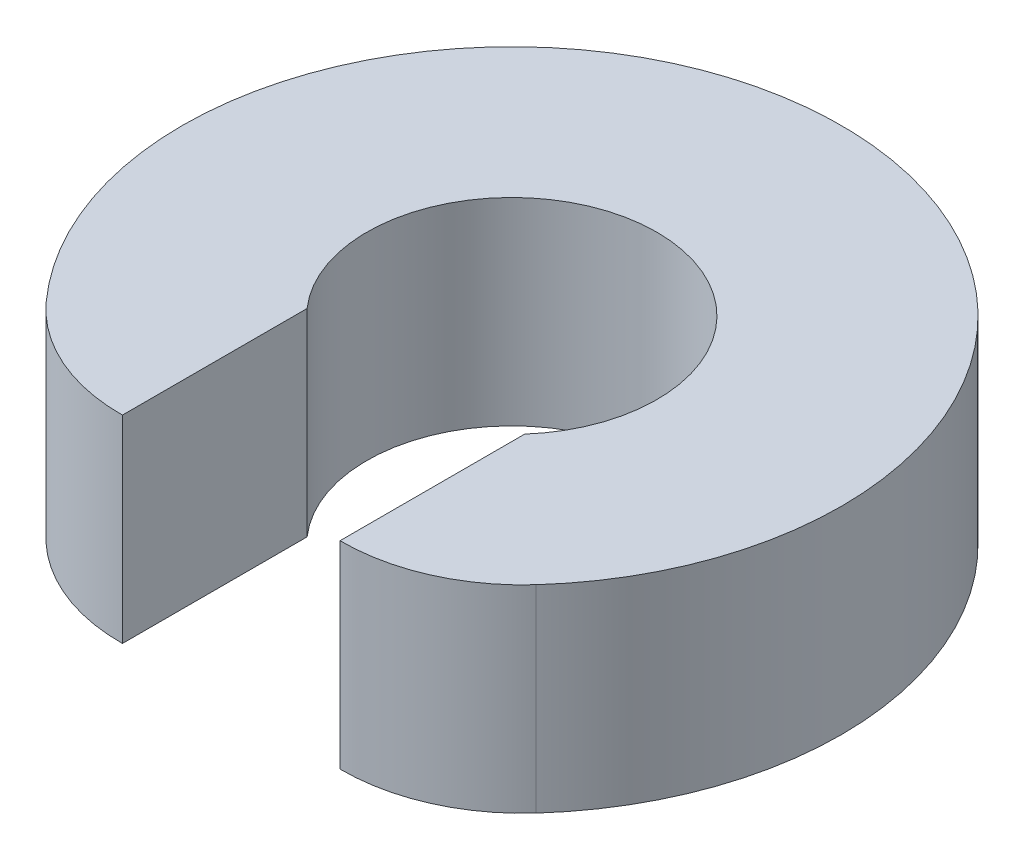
ISO-10303-21;
HEADER;
FILE_DESCRIPTION(('STEP AP214'),'2;1');
FILE_NAME('part.step','',(''),(''),'','','');
FILE_SCHEMA(('AUTOMOTIVE_DESIGN { 1 0 10303 214 1 1 1 1 }'));
ENDSEC;
DATA;
#1=APPLICATION_CONTEXT('core data for automotive mechanical design processes');
#2=APPLICATION_PROTOCOL_DEFINITION('international standard','automotive_design',2000,#1);
#3=PRODUCT_CONTEXT('',#1,'mechanical');
#4=PRODUCT('Part','Part','',(#3));
#5=PRODUCT_RELATED_PRODUCT_CATEGORY('part','',(#4));
#6=PRODUCT_DEFINITION_FORMATION('','',#4);
#7=PRODUCT_DEFINITION_CONTEXT('part definition',#1,'design');
#8=PRODUCT_DEFINITION('design','',#6,#7);
#9=PRODUCT_DEFINITION_SHAPE('','',#8);
#10=(LENGTH_UNIT() NAMED_UNIT(*) SI_UNIT(.MILLI.,.METRE.));
#11=(NAMED_UNIT(*) PLANE_ANGLE_UNIT() SI_UNIT($,.RADIAN.));
#12=(NAMED_UNIT(*) SI_UNIT($,.STERADIAN.) SOLID_ANGLE_UNIT());
#13=UNCERTAINTY_MEASURE_WITH_UNIT(LENGTH_MEASURE(1.E-05),#10,'distance_accuracy_value','');
#14=(GEOMETRIC_REPRESENTATION_CONTEXT(3) GLOBAL_UNCERTAINTY_ASSIGNED_CONTEXT((#13)) GLOBAL_UNIT_ASSIGNED_CONTEXT((#10,
#11,#12)) REPRESENTATION_CONTEXT('',''));
#15=CARTESIAN_POINT('',(0.,0.,0.));
#16=DIRECTION('',(0.,0.,1.));
#17=DIRECTION('',(1.,0.,0.));
#18=AXIS2_PLACEMENT_3D('',#15,#16,#17);
#19=CARTESIAN_POINT('',(0.,0.,0.));
#20=DIRECTION('',(0.,1.,0.));
#21=DIRECTION('',(0.,0.,1.));
#22=AXIS2_PLACEMENT_3D('',#19,#20,#21);
#23=PLANE('',#22);
#24=CARTESIAN_POINT('',(167.207585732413,0.,150.554386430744));
#25=DIRECTION('',(0.,-1.,0.));
#26=DIRECTION('',(0.,0.,-1.));
#27=AXIS2_PLACEMENT_3D('',#24,#25,#26);
#28=CIRCLE('',#27,275.);
#29=CARTESIAN_POINT('',(165.,0.,425.545525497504));
#30=VERTEX_POINT('',#29);
#31=CARTESIAN_POINT('',(371.572412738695,0.,334.565303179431));
#32=VERTEX_POINT('',#31);
#33=EDGE_CURVE('E94',#30,#32,#28,.F.);
#34=ORIENTED_EDGE('',*,*,#33,.F.);
#35=DIRECTION('',(0.,0.,-1.));
#36=VECTOR('',#35,1.);
#37=CARTESIAN_POINT('',(165.,0.,0.));
#38=LINE('',#37,#36);
#39=CARTESIAN_POINT('',(165.,0.,145.516322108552));
#40=VERTEX_POINT('',#39);
#41=EDGE_CURVE('E126',#30,#40,#38,.T.);
#42=ORIENTED_EDGE('',*,*,#41,.T.);
#43=CARTESIAN_POINT('',(0.,0.,0.));
#44=DIRECTION('',(0.,-1.,0.));
#45=DIRECTION('',(0.,0.,-1.));
#46=AXIS2_PLACEMENT_3D('',#43,#44,#45);
#47=CIRCLE('',#46,220.);
#48=CARTESIAN_POINT('',(-165.,0.,145.516322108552));
#49=VERTEX_POINT('',#48);
#50=EDGE_CURVE('E130',#40,#49,#47,.F.);
#51=ORIENTED_EDGE('',*,*,#50,.T.);
#52=DIRECTION('',(0.,0.,-1.));
#53=VECTOR('',#52,1.);
#54=CARTESIAN_POINT('',(-165.,0.,0.));
#55=LINE('',#54,#53);
#56=CARTESIAN_POINT('',(-165.,0.,425.545525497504));
#57=VERTEX_POINT('',#56);
#58=EDGE_CURVE('E107',#57,#49,#55,.T.);
#59=ORIENTED_EDGE('',*,*,#58,.F.);
#60=CARTESIAN_POINT('',(-167.207585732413,0.,150.554386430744));
#61=DIRECTION('',(0.,-1.,0.));
#62=DIRECTION('',(0.,0.,-1.));
#63=AXIS2_PLACEMENT_3D('',#60,#61,#62);
#64=CIRCLE('',#63,275.);
#65=CARTESIAN_POINT('',(-371.572412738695,0.,334.565303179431));
#66=VERTEX_POINT('',#65);
#67=EDGE_CURVE('E105',#66,#57,#64,.F.);
#68=ORIENTED_EDGE('',*,*,#67,.F.);
#69=CARTESIAN_POINT('',(0.,0.,0.));
#70=DIRECTION('',(0.,-1.,0.));
#71=DIRECTION('',(0.,0.,-1.));
#72=AXIS2_PLACEMENT_3D('',#69,#70,#71);
#73=CIRCLE('',#72,500.);
#74=EDGE_CURVE('E89',#32,#66,#73,.F.);
#75=ORIENTED_EDGE('',*,*,#74,.F.);
#76=EDGE_LOOP('',(#34,#42,#51,#59,#68,#75));
#77=FACE_BOUND('',#76,.T.);
#78=ADVANCED_FACE('F39',(#77),#23,.F.);
#79=CARTESIAN_POINT('',(0.,200.,0.));
#80=DIRECTION('',(0.,-1.,0.));
#81=DIRECTION('',(0.,0.,-1.));
#82=AXIS2_PLACEMENT_3D('',#79,#80,#81);
#83=CYLINDRICAL_SURFACE('',#82,500.);
#84=ORIENTED_EDGE('',*,*,#74,.T.);
#85=DIRECTION('',(0.,-1.,0.));
#86=VECTOR('',#85,1.);
#87=CARTESIAN_POINT('',(-371.572412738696,200.,334.565303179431));
#88=LINE('',#87,#86);
#89=CARTESIAN_POINT('',(-371.572412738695,300.,334.565303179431));
#90=VERTEX_POINT('',#89);
#91=EDGE_CURVE('E111',#90,#66,#88,.T.);
#92=ORIENTED_EDGE('',*,*,#91,.F.);
#93=CARTESIAN_POINT('',(0.,300.,0.));
#94=DIRECTION('',(0.,-1.,0.));
#95=DIRECTION('',(0.,0.,-1.));
#96=AXIS2_PLACEMENT_3D('',#93,#94,#95);
#97=CIRCLE('',#96,500.);
#98=CARTESIAN_POINT('',(371.572412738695,300.,334.565303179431));
#99=VERTEX_POINT('',#98);
#100=EDGE_CURVE('E81',#99,#90,#97,.F.);
#101=ORIENTED_EDGE('',*,*,#100,.F.);
#102=DIRECTION('',(0.,-1.,0.));
#103=VECTOR('',#102,1.);
#104=CARTESIAN_POINT('',(371.572412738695,200.,334.565303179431));
#105=LINE('',#104,#103);
#106=EDGE_CURVE('E115',#32,#99,#105,.F.);
#107=ORIENTED_EDGE('',*,*,#106,.F.);
#108=EDGE_LOOP('',(#84,#92,#101,#107));
#109=FACE_BOUND('',#108,.T.);
#110=ADVANCED_FACE('F113',(#109),#83,.T.);
#111=CARTESIAN_POINT('',(-167.207585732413,200.,150.554386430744));
#112=DIRECTION('',(0.,-1.,0.));
#113=DIRECTION('',(0.,0.,-1.));
#114=AXIS2_PLACEMENT_3D('',#111,#112,#113);
#115=CYLINDRICAL_SURFACE('',#114,275.);
#116=CARTESIAN_POINT('',(-167.207585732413,300.,150.554386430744));
#117=DIRECTION('',(0.,-1.,0.));
#118=DIRECTION('',(0.,0.,-1.));
#119=AXIS2_PLACEMENT_3D('',#116,#117,#118);
#120=CIRCLE('',#119,275.);
#121=CARTESIAN_POINT('',(-165.,300.,425.545525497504));
#122=VERTEX_POINT('',#121);
#123=EDGE_CURVE('E119',#90,#122,#120,.F.);
#124=ORIENTED_EDGE('',*,*,#123,.F.);
#125=ORIENTED_EDGE('',*,*,#91,.T.);
#126=ORIENTED_EDGE('',*,*,#67,.T.);
#127=DIRECTION('',(0.,1.,0.));
#128=VECTOR('',#127,1.);
#129=CARTESIAN_POINT('',(-165.,200.,425.545525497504));
#130=LINE('',#129,#128);
#131=EDGE_CURVE('E121',#122,#57,#130,.F.);
#132=ORIENTED_EDGE('',*,*,#131,.F.);
#133=EDGE_LOOP('',(#124,#125,#126,#132));
#134=FACE_BOUND('',#133,.T.);
#135=ADVANCED_FACE('F117',(#134),#115,.T.);
#136=CARTESIAN_POINT('',(-165.,200.,0.));
#137=DIRECTION('',(1.,0.,0.));
#138=DIRECTION('',(0.,0.,-1.));
#139=AXIS2_PLACEMENT_3D('',#136,#137,#138);
#140=PLANE('',#139);
#141=DIRECTION('',(0.,0.,1.));
#142=VECTOR('',#141,1.);
#143=CARTESIAN_POINT('',(-165.,300.,0.));
#144=LINE('',#143,#142);
#145=CARTESIAN_POINT('',(-165.,300.,145.516322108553));
#146=VERTEX_POINT('',#145);
#147=EDGE_CURVE('E135',#122,#146,#144,.F.);
#148=ORIENTED_EDGE('',*,*,#147,.F.);
#149=ORIENTED_EDGE('',*,*,#131,.T.);
#150=ORIENTED_EDGE('',*,*,#58,.T.);
#151=DIRECTION('',(0.,-1.,0.));
#152=VECTOR('',#151,1.);
#153=CARTESIAN_POINT('',(-165.,200.,145.516322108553));
#154=LINE('',#153,#152);
#155=EDGE_CURVE('E131',#49,#146,#154,.F.);
#156=ORIENTED_EDGE('',*,*,#155,.T.);
#157=EDGE_LOOP('',(#148,#149,#150,#156));
#158=FACE_BOUND('',#157,.T.);
#159=ADVANCED_FACE('F144',(#158),#140,.T.);
#160=CARTESIAN_POINT('',(0.,200.,0.));
#161=DIRECTION('',(0.,-1.,0.));
#162=DIRECTION('',(0.,0.,-1.));
#163=AXIS2_PLACEMENT_3D('',#160,#161,#162);
#164=CYLINDRICAL_SURFACE('',#163,220.);
#165=DIRECTION('',(0.,1.,0.));
#166=VECTOR('',#165,1.);
#167=CARTESIAN_POINT('',(165.,200.,145.516322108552));
#168=LINE('',#167,#166);
#169=CARTESIAN_POINT('',(165.,300.,145.516322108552));
#170=VERTEX_POINT('',#169);
#171=EDGE_CURVE('E127',#40,#170,#168,.T.);
#172=ORIENTED_EDGE('',*,*,#171,.T.);
#173=CARTESIAN_POINT('',(0.,300.,0.));
#174=DIRECTION('',(0.,-1.,0.));
#175=DIRECTION('',(0.,0.,-1.));
#176=AXIS2_PLACEMENT_3D('',#173,#174,#175);
#177=CIRCLE('',#176,220.);
#178=EDGE_CURVE('E63',#146,#170,#177,.T.);
#179=ORIENTED_EDGE('',*,*,#178,.F.);
#180=ORIENTED_EDGE('',*,*,#155,.F.);
#181=ORIENTED_EDGE('',*,*,#50,.F.);
#182=EDGE_LOOP('',(#172,#179,#180,#181));
#183=FACE_BOUND('',#182,.T.);
#184=ADVANCED_FACE('F155',(#183),#164,.F.);
#185=CARTESIAN_POINT('',(165.,200.,0.));
#186=DIRECTION('',(1.,0.,0.));
#187=DIRECTION('',(0.,0.,-1.));
#188=AXIS2_PLACEMENT_3D('',#185,#186,#187);
#189=PLANE('',#188);
#190=DIRECTION('',(0.,-1.,0.));
#191=VECTOR('',#190,1.);
#192=CARTESIAN_POINT('',(165.,200.,425.545525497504));
#193=LINE('',#192,#191);
#194=CARTESIAN_POINT('',(165.,300.,425.545525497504));
#195=VERTEX_POINT('',#194);
#196=EDGE_CURVE('E54',#195,#30,#193,.T.);
#197=ORIENTED_EDGE('',*,*,#196,.F.);
#198=DIRECTION('',(0.,0.,1.));
#199=VECTOR('',#198,1.);
#200=CARTESIAN_POINT('',(165.,300.,0.));
#201=LINE('',#200,#199);
#202=EDGE_CURVE('E47',#170,#195,#201,.T.);
#203=ORIENTED_EDGE('',*,*,#202,.F.);
#204=ORIENTED_EDGE('',*,*,#171,.F.);
#205=ORIENTED_EDGE('',*,*,#41,.F.);
#206=EDGE_LOOP('',(#197,#203,#204,#205));
#207=FACE_BOUND('',#206,.T.);
#208=ADVANCED_FACE('F150',(#207),#189,.F.);
#209=CARTESIAN_POINT('',(167.207585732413,200.,150.554386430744));
#210=DIRECTION('',(0.,-1.,0.));
#211=DIRECTION('',(0.,0.,-1.));
#212=AXIS2_PLACEMENT_3D('',#209,#210,#211);
#213=CYLINDRICAL_SURFACE('',#212,275.);
#214=CARTESIAN_POINT('',(167.207585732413,300.,150.554386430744));
#215=DIRECTION('',(0.,-1.,0.));
#216=DIRECTION('',(0.,0.,-1.));
#217=AXIS2_PLACEMENT_3D('',#214,#215,#216);
#218=CIRCLE('',#217,275.);
#219=EDGE_CURVE('E12',#195,#99,#218,.F.);
#220=ORIENTED_EDGE('',*,*,#219,.F.);
#221=ORIENTED_EDGE('',*,*,#196,.T.);
#222=ORIENTED_EDGE('',*,*,#33,.T.);
#223=ORIENTED_EDGE('',*,*,#106,.T.);
#224=EDGE_LOOP('',(#220,#221,#222,#223));
#225=FACE_BOUND('',#224,.T.);
#226=ADVANCED_FACE('F146',(#225),#213,.T.);
#227=CARTESIAN_POINT('',(0.,300.,0.));
#228=DIRECTION('',(0.,1.,0.));
#229=DIRECTION('',(0.,0.,1.));
#230=AXIS2_PLACEMENT_3D('',#227,#228,#229);
#231=PLANE('',#230);
#232=ORIENTED_EDGE('',*,*,#202,.T.);
#233=ORIENTED_EDGE('',*,*,#219,.T.);
#234=ORIENTED_EDGE('',*,*,#100,.T.);
#235=ORIENTED_EDGE('',*,*,#123,.T.);
#236=ORIENTED_EDGE('',*,*,#147,.T.);
#237=ORIENTED_EDGE('',*,*,#178,.T.);
#238=EDGE_LOOP('',(#232,#233,#234,#235,#236,#237));
#239=FACE_BOUND('',#238,.T.);
#240=ADVANCED_FACE('F41',(#239),#231,.T.);
#241=CLOSED_SHELL('',(#78,#110,#135,#159,#184,#208,#226,#240));
#242=MANIFOLD_SOLID_BREP('B2',#241);
#243=ADVANCED_BREP_SHAPE_REPRESENTATION('',(#18,#242),#14);
#244=SHAPE_DEFINITION_REPRESENTATION(#9,#243);
ENDSEC;
END-ISO-10303-21;
